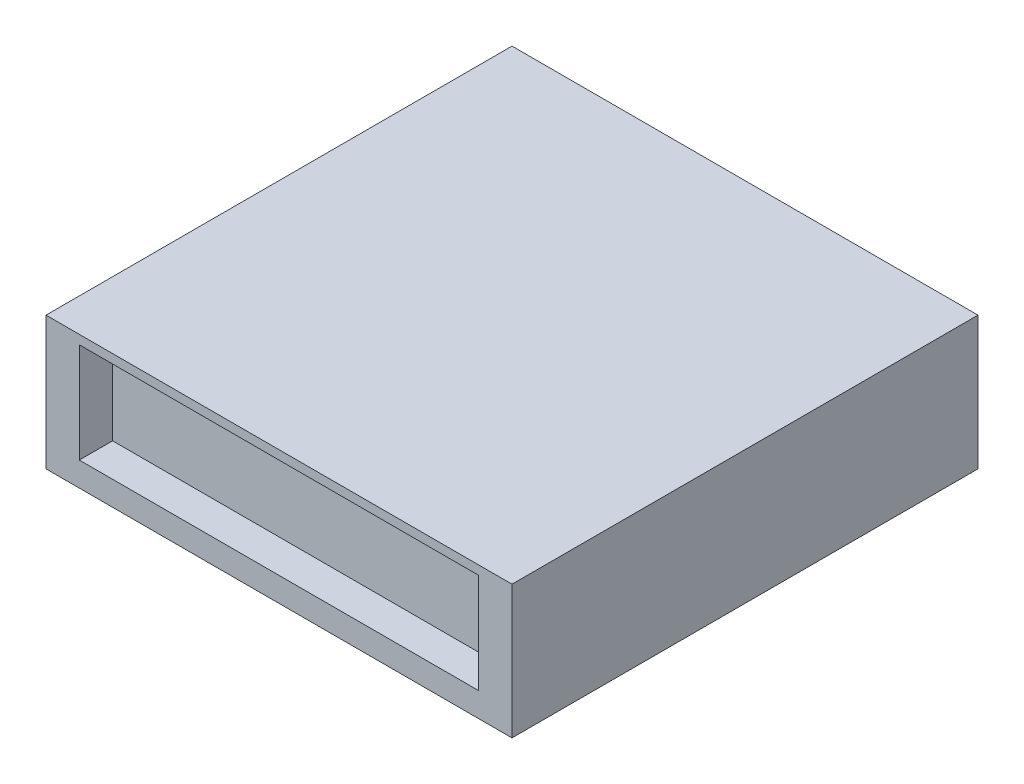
ISO-10303-21;
HEADER;
FILE_DESCRIPTION(('STEP AP214'),'2;1');
FILE_NAME('part.step','',(''),(''),'','','');
FILE_SCHEMA(('AUTOMOTIVE_DESIGN { 1 0 10303 214 1 1 1 1 }'));
ENDSEC;
DATA;
#1=APPLICATION_CONTEXT('core data for automotive mechanical design processes');
#2=APPLICATION_PROTOCOL_DEFINITION('international standard','automotive_design',2000,#1);
#3=PRODUCT_CONTEXT('',#1,'mechanical');
#4=PRODUCT('Part','Part','',(#3));
#5=PRODUCT_RELATED_PRODUCT_CATEGORY('part','',(#4));
#6=PRODUCT_DEFINITION_FORMATION('','',#4);
#7=PRODUCT_DEFINITION_CONTEXT('part definition',#1,'design');
#8=PRODUCT_DEFINITION('design','',#6,#7);
#9=PRODUCT_DEFINITION_SHAPE('','',#8);
#10=(LENGTH_UNIT() NAMED_UNIT(*) SI_UNIT(.MILLI.,.METRE.));
#11=(NAMED_UNIT(*) PLANE_ANGLE_UNIT() SI_UNIT($,.RADIAN.));
#12=(NAMED_UNIT(*) SI_UNIT($,.STERADIAN.) SOLID_ANGLE_UNIT());
#13=UNCERTAINTY_MEASURE_WITH_UNIT(LENGTH_MEASURE(1.E-05),#10,'distance_accuracy_value','');
#14=(GEOMETRIC_REPRESENTATION_CONTEXT(3) GLOBAL_UNCERTAINTY_ASSIGNED_CONTEXT((#13)) GLOBAL_UNIT_ASSIGNED_CONTEXT((#10,
#11,#12)) REPRESENTATION_CONTEXT('',''));
#15=CARTESIAN_POINT('',(0.,0.,0.));
#16=DIRECTION('',(0.,0.,1.));
#17=DIRECTION('',(1.,0.,0.));
#18=AXIS2_PLACEMENT_3D('',#15,#16,#17);
#19=CARTESIAN_POINT('',(0.,25.4,0.));
#20=DIRECTION('',(1.,0.,0.));
#21=DIRECTION('',(0.,0.,-1.));
#22=AXIS2_PLACEMENT_3D('',#19,#20,#21);
#23=PLANE('',#22);
#24=DIRECTION('',(0.,0.,1.));
#25=VECTOR('',#24,1.);
#26=CARTESIAN_POINT('',(0.,0.,0.));
#27=LINE('',#26,#25);
#28=CARTESIAN_POINT('',(0.,0.,-88.9));
#29=VERTEX_POINT('',#28);
#30=CARTESIAN_POINT('',(0.,0.,0.));
#31=VERTEX_POINT('',#30);
#32=EDGE_CURVE('E141',#29,#31,#27,.T.);
#33=ORIENTED_EDGE('',*,*,#32,.T.);
#34=DIRECTION('',(0.,-1.,0.));
#35=VECTOR('',#34,1.);
#36=CARTESIAN_POINT('',(0.,25.4,0.));
#37=LINE('',#36,#35);
#38=CARTESIAN_POINT('',(0.,25.4,0.));
#39=VERTEX_POINT('',#38);
#40=EDGE_CURVE('E11',#39,#31,#37,.T.);
#41=ORIENTED_EDGE('',*,*,#40,.F.);
#42=DIRECTION('',(0.,0.,1.));
#43=VECTOR('',#42,1.);
#44=CARTESIAN_POINT('',(0.,25.4,0.));
#45=LINE('',#44,#43);
#46=CARTESIAN_POINT('',(0.,25.4,-88.9));
#47=VERTEX_POINT('',#46);
#48=EDGE_CURVE('E145',#47,#39,#45,.T.);
#49=ORIENTED_EDGE('',*,*,#48,.F.);
#50=DIRECTION('',(0.,-1.,0.));
#51=VECTOR('',#50,1.);
#52=CARTESIAN_POINT('',(0.,25.4,-88.9));
#53=LINE('',#52,#51);
#54=EDGE_CURVE('E151',#47,#29,#53,.T.);
#55=ORIENTED_EDGE('',*,*,#54,.T.);
#56=EDGE_LOOP('',(#33,#41,#49,#55));
#57=FACE_BOUND('',#56,.T.);
#58=ADVANCED_FACE('F33',(#57),#23,.F.);
#59=CARTESIAN_POINT('',(0.,25.4,0.));
#60=DIRECTION('',(0.,0.,-1.));
#61=DIRECTION('',(-1.,0.,0.));
#62=AXIS2_PLACEMENT_3D('',#59,#60,#61);
#63=PLANE('',#62);
#64=DIRECTION('',(1.,0.,0.));
#65=VECTOR('',#64,1.);
#66=CARTESIAN_POINT('',(6.34999999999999,4.63307752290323,0.));
#67=LINE('',#66,#65);
#68=CARTESIAN_POINT('',(6.34999999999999,4.63307752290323,0.));
#69=VERTEX_POINT('',#68);
#70=CARTESIAN_POINT('',(82.55,4.63307752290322,0.));
#71=VERTEX_POINT('',#70);
#72=EDGE_CURVE('E135',#69,#71,#67,.T.);
#73=ORIENTED_EDGE('',*,*,#72,.F.);
#74=DIRECTION('',(0.,-1.,0.));
#75=VECTOR('',#74,1.);
#76=CARTESIAN_POINT('',(6.34999999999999,23.6830775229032,0.));
#77=LINE('',#76,#75);
#78=CARTESIAN_POINT('',(6.34999999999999,23.6830775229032,0.));
#79=VERTEX_POINT('',#78);
#80=EDGE_CURVE('E47',#79,#69,#77,.T.);
#81=ORIENTED_EDGE('',*,*,#80,.F.);
#82=DIRECTION('',(-1.,0.,0.));
#83=VECTOR('',#82,1.);
#84=CARTESIAN_POINT('',(6.34999999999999,23.6830775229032,0.));
#85=LINE('',#84,#83);
#86=CARTESIAN_POINT('',(82.55,23.6830775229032,0.));
#87=VERTEX_POINT('',#86);
#88=EDGE_CURVE('E126',#87,#79,#85,.T.);
#89=ORIENTED_EDGE('',*,*,#88,.F.);
#90=DIRECTION('',(0.,1.,0.));
#91=VECTOR('',#90,1.);
#92=CARTESIAN_POINT('',(82.55,23.6830775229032,0.));
#93=LINE('',#92,#91);
#94=EDGE_CURVE('E129',#71,#87,#93,.T.);
#95=ORIENTED_EDGE('',*,*,#94,.F.);
#96=EDGE_LOOP('',(#73,#81,#89,#95));
#97=FACE_BOUND('',#96,.T.);
#98=DIRECTION('',(1.,0.,0.));
#99=VECTOR('',#98,1.);
#100=CARTESIAN_POINT('',(0.,0.,0.));
#101=LINE('',#100,#99);
#102=CARTESIAN_POINT('',(88.9,0.,0.));
#103=VERTEX_POINT('',#102);
#104=EDGE_CURVE('E154',#31,#103,#101,.T.);
#105=ORIENTED_EDGE('',*,*,#104,.T.);
#106=DIRECTION('',(0.,-1.,0.));
#107=VECTOR('',#106,1.);
#108=CARTESIAN_POINT('',(88.9,25.4,0.));
#109=LINE('',#108,#107);
#110=CARTESIAN_POINT('',(88.9,25.4,0.));
#111=VERTEX_POINT('',#110);
#112=EDGE_CURVE('E40',#111,#103,#109,.T.);
#113=ORIENTED_EDGE('',*,*,#112,.F.);
#114=DIRECTION('',(1.,0.,0.));
#115=VECTOR('',#114,1.);
#116=CARTESIAN_POINT('',(0.,25.4,0.));
#117=LINE('',#116,#115);
#118=EDGE_CURVE('E84',#39,#111,#117,.T.);
#119=ORIENTED_EDGE('',*,*,#118,.F.);
#120=ORIENTED_EDGE('',*,*,#40,.T.);
#121=EDGE_LOOP('',(#105,#113,#119,#120));
#122=FACE_BOUND('',#121,.T.);
#123=ADVANCED_FACE('F182',(#97,#122),#63,.F.);
#124=CARTESIAN_POINT('',(88.9,25.4,0.));
#125=DIRECTION('',(-1.,0.,0.));
#126=DIRECTION('',(0.,0.,1.));
#127=AXIS2_PLACEMENT_3D('',#124,#125,#126);
#128=PLANE('',#127);
#129=DIRECTION('',(0.,0.,-1.));
#130=VECTOR('',#129,1.);
#131=CARTESIAN_POINT('',(88.9,0.,0.));
#132=LINE('',#131,#130);
#133=CARTESIAN_POINT('',(88.9,0.,-88.9));
#134=VERTEX_POINT('',#133);
#135=EDGE_CURVE('E156',#103,#134,#132,.T.);
#136=ORIENTED_EDGE('',*,*,#135,.T.);
#137=DIRECTION('',(0.,-1.,0.));
#138=VECTOR('',#137,1.);
#139=CARTESIAN_POINT('',(88.9,25.4,-88.9));
#140=LINE('',#139,#138);
#141=CARTESIAN_POINT('',(88.9,25.4,-88.9));
#142=VERTEX_POINT('',#141);
#143=EDGE_CURVE('E160',#142,#134,#140,.T.);
#144=ORIENTED_EDGE('',*,*,#143,.F.);
#145=DIRECTION('',(0.,0.,-1.));
#146=VECTOR('',#145,1.);
#147=CARTESIAN_POINT('',(88.9,25.4,0.));
#148=LINE('',#147,#146);
#149=EDGE_CURVE('E148',#111,#142,#148,.T.);
#150=ORIENTED_EDGE('',*,*,#149,.F.);
#151=ORIENTED_EDGE('',*,*,#112,.T.);
#152=EDGE_LOOP('',(#136,#144,#150,#151));
#153=FACE_BOUND('',#152,.T.);
#154=ADVANCED_FACE('F165',(#153),#128,.F.);
#155=CARTESIAN_POINT('',(0.,25.4,-88.9));
#156=DIRECTION('',(0.,0.,1.));
#157=DIRECTION('',(1.,0.,0.));
#158=AXIS2_PLACEMENT_3D('',#155,#156,#157);
#159=PLANE('',#158);
#160=DIRECTION('',(-1.,0.,0.));
#161=VECTOR('',#160,1.);
#162=CARTESIAN_POINT('',(0.,0.,-88.9));
#163=LINE('',#162,#161);
#164=EDGE_CURVE('E77',#134,#29,#163,.T.);
#165=ORIENTED_EDGE('',*,*,#164,.T.);
#166=ORIENTED_EDGE('',*,*,#54,.F.);
#167=DIRECTION('',(-1.,0.,0.));
#168=VECTOR('',#167,1.);
#169=CARTESIAN_POINT('',(0.,25.4,-88.9));
#170=LINE('',#169,#168);
#171=EDGE_CURVE('E56',#142,#47,#170,.T.);
#172=ORIENTED_EDGE('',*,*,#171,.F.);
#173=ORIENTED_EDGE('',*,*,#143,.T.);
#174=EDGE_LOOP('',(#165,#166,#172,#173));
#175=FACE_BOUND('',#174,.T.);
#176=ADVANCED_FACE('F173',(#175),#159,.F.);
#177=CARTESIAN_POINT('',(0.,25.4,-88.9));
#178=DIRECTION('',(0.,-1.,0.));
#179=DIRECTION('',(0.,0.,-1.));
#180=AXIS2_PLACEMENT_3D('',#177,#178,#179);
#181=PLANE('',#180);
#182=ORIENTED_EDGE('',*,*,#48,.T.);
#183=ORIENTED_EDGE('',*,*,#118,.T.);
#184=ORIENTED_EDGE('',*,*,#149,.T.);
#185=ORIENTED_EDGE('',*,*,#171,.T.);
#186=EDGE_LOOP('',(#182,#183,#184,#185));
#187=FACE_BOUND('',#186,.T.);
#188=ADVANCED_FACE('F175',(#187),#181,.F.);
#189=CARTESIAN_POINT('',(0.,0.,-88.9));
#190=DIRECTION('',(0.,-1.,0.));
#191=DIRECTION('',(0.,0.,-1.));
#192=AXIS2_PLACEMENT_3D('',#189,#190,#191);
#193=PLANE('',#192);
#194=ORIENTED_EDGE('',*,*,#32,.F.);
#195=ORIENTED_EDGE('',*,*,#164,.F.);
#196=ORIENTED_EDGE('',*,*,#135,.F.);
#197=ORIENTED_EDGE('',*,*,#104,.F.);
#198=EDGE_LOOP('',(#194,#195,#196,#197));
#199=FACE_BOUND('',#198,.T.);
#200=ADVANCED_FACE('F169',(#199),#193,.T.);
#201=CARTESIAN_POINT('',(6.34999999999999,23.6830775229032,-6.35));
#202=DIRECTION('',(-1.,0.,0.));
#203=DIRECTION('',(0.,-1.,0.));
#204=AXIS2_PLACEMENT_3D('',#201,#202,#203);
#205=PLANE('',#204);
#206=ORIENTED_EDGE('',*,*,#80,.T.);
#207=DIRECTION('',(0.,0.,1.));
#208=VECTOR('',#207,1.);
#209=CARTESIAN_POINT('',(6.34999999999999,4.63307752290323,-6.35));
#210=LINE('',#209,#208);
#211=CARTESIAN_POINT('',(6.34999999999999,4.63307752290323,-6.35));
#212=VERTEX_POINT('',#211);
#213=EDGE_CURVE('E104',#212,#69,#210,.T.);
#214=ORIENTED_EDGE('',*,*,#213,.F.);
#215=DIRECTION('',(0.,-1.,0.));
#216=VECTOR('',#215,1.);
#217=CARTESIAN_POINT('',(6.34999999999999,23.6830775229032,-6.35));
#218=LINE('',#217,#216);
#219=CARTESIAN_POINT('',(6.34999999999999,23.6830775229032,-6.35));
#220=VERTEX_POINT('',#219);
#221=EDGE_CURVE('E108',#220,#212,#218,.T.);
#222=ORIENTED_EDGE('',*,*,#221,.F.);
#223=DIRECTION('',(0.,0.,1.));
#224=VECTOR('',#223,1.);
#225=CARTESIAN_POINT('',(6.34999999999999,23.6830775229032,-6.35));
#226=LINE('',#225,#224);
#227=EDGE_CURVE('E139',#220,#79,#226,.T.);
#228=ORIENTED_EDGE('',*,*,#227,.T.);
#229=EDGE_LOOP('',(#206,#214,#222,#228));
#230=FACE_BOUND('',#229,.T.);
#231=ADVANCED_FACE('F106',(#230),#205,.F.);
#232=CARTESIAN_POINT('',(6.34999999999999,23.6830775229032,-6.35));
#233=DIRECTION('',(0.,1.,0.));
#234=DIRECTION('',(0.,0.,1.));
#235=AXIS2_PLACEMENT_3D('',#232,#233,#234);
#236=PLANE('',#235);
#237=ORIENTED_EDGE('',*,*,#88,.T.);
#238=ORIENTED_EDGE('',*,*,#227,.F.);
#239=DIRECTION('',(-1.,0.,0.));
#240=VECTOR('',#239,1.);
#241=CARTESIAN_POINT('',(6.34999999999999,23.6830775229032,-6.35));
#242=LINE('',#241,#240);
#243=CARTESIAN_POINT('',(82.55,23.6830775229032,-6.35));
#244=VERTEX_POINT('',#243);
#245=EDGE_CURVE('E114',#244,#220,#242,.T.);
#246=ORIENTED_EDGE('',*,*,#245,.F.);
#247=DIRECTION('',(0.,0.,1.));
#248=VECTOR('',#247,1.);
#249=CARTESIAN_POINT('',(82.55,23.6830775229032,-6.35));
#250=LINE('',#249,#248);
#251=EDGE_CURVE('E142',#244,#87,#250,.T.);
#252=ORIENTED_EDGE('',*,*,#251,.T.);
#253=EDGE_LOOP('',(#237,#238,#246,#252));
#254=FACE_BOUND('',#253,.T.);
#255=ADVANCED_FACE('F199',(#254),#236,.F.);
#256=CARTESIAN_POINT('',(82.55,23.6830775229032,-6.35));
#257=DIRECTION('',(1.,0.,0.));
#258=DIRECTION('',(0.,0.,-1.));
#259=AXIS2_PLACEMENT_3D('',#256,#257,#258);
#260=PLANE('',#259);
#261=ORIENTED_EDGE('',*,*,#94,.T.);
#262=ORIENTED_EDGE('',*,*,#251,.F.);
#263=DIRECTION('',(0.,1.,0.));
#264=VECTOR('',#263,1.);
#265=CARTESIAN_POINT('',(82.55,23.6830775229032,-6.35));
#266=LINE('',#265,#264);
#267=CARTESIAN_POINT('',(82.55,4.63307752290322,-6.35));
#268=VERTEX_POINT('',#267);
#269=EDGE_CURVE('E122',#268,#244,#266,.T.);
#270=ORIENTED_EDGE('',*,*,#269,.F.);
#271=DIRECTION('',(0.,0.,1.));
#272=VECTOR('',#271,1.);
#273=CARTESIAN_POINT('',(82.55,4.63307752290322,-6.35));
#274=LINE('',#273,#272);
#275=EDGE_CURVE('E113',#268,#71,#274,.T.);
#276=ORIENTED_EDGE('',*,*,#275,.T.);
#277=EDGE_LOOP('',(#261,#262,#270,#276));
#278=FACE_BOUND('',#277,.T.);
#279=ADVANCED_FACE('F197',(#278),#260,.F.);
#280=CARTESIAN_POINT('',(6.34999999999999,4.63307752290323,-6.35));
#281=DIRECTION('',(0.,-1.,0.));
#282=DIRECTION('',(1.,0.,0.));
#283=AXIS2_PLACEMENT_3D('',#280,#281,#282);
#284=PLANE('',#283);
#285=ORIENTED_EDGE('',*,*,#72,.T.);
#286=ORIENTED_EDGE('',*,*,#275,.F.);
#287=DIRECTION('',(1.,0.,0.));
#288=VECTOR('',#287,1.);
#289=CARTESIAN_POINT('',(6.34999999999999,4.63307752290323,-6.35));
#290=LINE('',#289,#288);
#291=EDGE_CURVE('E117',#212,#268,#290,.T.);
#292=ORIENTED_EDGE('',*,*,#291,.F.);
#293=ORIENTED_EDGE('',*,*,#213,.T.);
#294=EDGE_LOOP('',(#285,#286,#292,#293));
#295=FACE_BOUND('',#294,.T.);
#296=ADVANCED_FACE('F118',(#295),#284,.F.);
#297=CARTESIAN_POINT('',(6.34999999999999,4.63307752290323,-6.35));
#298=DIRECTION('',(0.,0.,1.));
#299=DIRECTION('',(1.,0.,0.));
#300=AXIS2_PLACEMENT_3D('',#297,#298,#299);
#301=PLANE('',#300);
#302=ORIENTED_EDGE('',*,*,#221,.T.);
#303=ORIENTED_EDGE('',*,*,#291,.T.);
#304=ORIENTED_EDGE('',*,*,#269,.T.);
#305=ORIENTED_EDGE('',*,*,#245,.T.);
#306=EDGE_LOOP('',(#302,#303,#304,#305));
#307=FACE_BOUND('',#306,.T.);
#308=ADVANCED_FACE('F124',(#307),#301,.T.);
#309=CLOSED_SHELL('',(#58,#123,#154,#176,#188,#200,#231,#255,#279,#296,#308));
#310=MANIFOLD_SOLID_BREP('B2',#309);
#311=ADVANCED_BREP_SHAPE_REPRESENTATION('',(#18,#310),#14);
#312=SHAPE_DEFINITION_REPRESENTATION(#9,#311);
ENDSEC;
END-ISO-10303-21;
